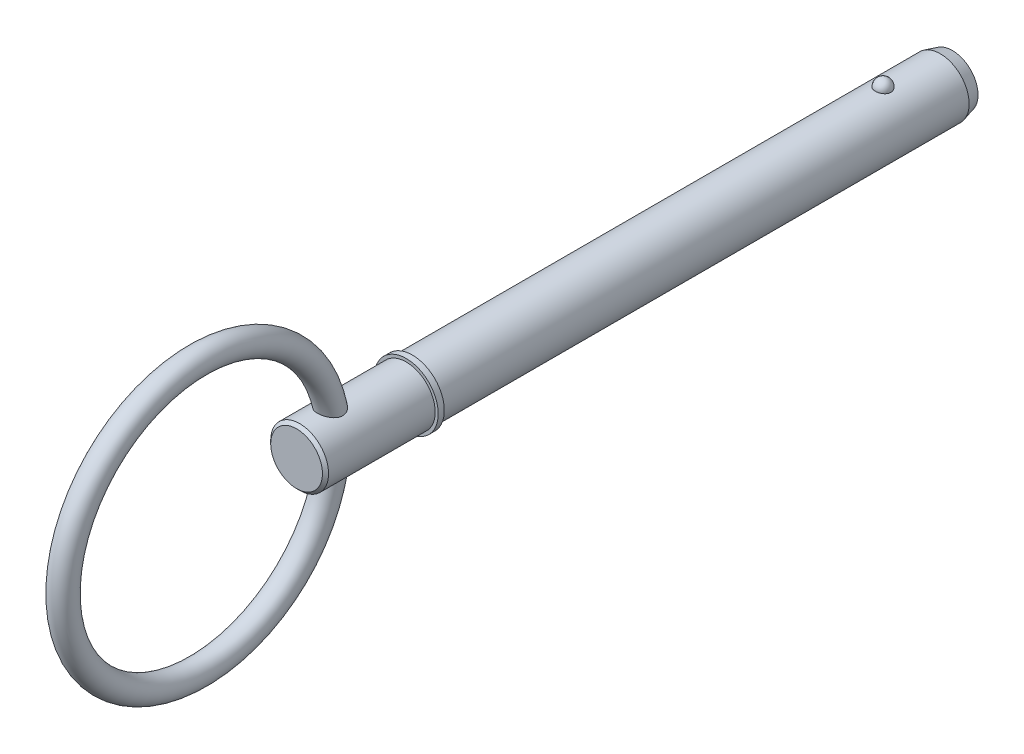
from build123d import *

# Parameters (mm, degrees)
SKETCH2_R           = 4.765
BOSS_EXTRUDE1_DEPTH = 76.2
BOSS_EXTRUDE2_START = 12.7
SKETCH3_R           = 4.765
BOSS_EXTRUDE2_DEPTH = 12.7
CHAMFER1_SIZE       = 2
CHAMFER1_SIZE2      = 0.535898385
SKETCH20_W          = 1
SKETCH20_H          = 5.265
SKETCH21_R          = 4.765
BOSS_EXTRUDE3_DEPTH = 19.05
CHAMFER2_SIZE       = 0.5
SKETCH24_R          = 2


with BuildPart() as part:
    # Sketch2 → Boss-Extrude1 (new body)
    with BuildSketch(Plane.XY):
        with Locations(Location((0, 0, 0), (0, 0, 180))):
            Circle(SKETCH2_R)
    extrude(amount=BOSS_EXTRUDE1_DEPTH)

    # Sketch3 → Boss-Extrude2 (add)
    with BuildSketch(Plane(origin=(0, 0, 0), x_dir=(-1, 0, 0), z_dir=(0, 0, -1)).offset(BOSS_EXTRUDE2_START)):
        Circle(SKETCH3_R)
    extrude(amount=-BOSS_EXTRUDE2_DEPTH)

    # Chamfer1
    chamfer1_edges = [part.edges().sort_by_distance(p)[0] for p in [
        (4.765, 0, -12.7),
    ]]
    chamfer1_side = [part.faces().sort_by_distance(p)[0] for p in [
        (4.765, 0, 31.75),
    ]]
    chamfer(chamfer1_edges, length=CHAMFER1_SIZE, length2=CHAMFER1_SIZE2, reference=chamfer1_side[0])

    # Sketch18 → Revolve1 (revolve)
    with BuildSketch(Plane(origin=(0, 0, 0), x_dir=(0, 0, -1), z_dir=(1, 0, 0))):
        with BuildLine():
            Line((1.29, 6.055), (1.29, 3.475))
            ThreePointArc((1.29, 3.475), (0, 4.765), (1.29, 6.055))
        make_face()
    revolve(axis=Axis((0, 6.055, -1.29), (0, -1, 0)))

    # Sketch20 → Revolve2 (revolve)
    with BuildSketch(Plane(origin=(0, 0, 0), x_dir=(0, 0, -1), z_dir=(1, 0, 0)), mode=Mode.PRIVATE) as revolve2_sk:
        with Locations((-76.7, 2.6325)):
            Rectangle(SKETCH20_W, SKETCH20_H)
    revolve(revolve2_sk.sketch.rotate(Axis((0, 0, 33.728787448), (0, 0, 1)), 90), axis=Axis((0, 0, 33.728787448), (0, 0, 1)))

    # Sketch21 → Boss-Extrude3 (add)
    with BuildSketch(Plane(origin=(0, 0, 76.2), x_dir=(-1, 0, 0), z_dir=(0, 0, -1))):
        Circle(SKETCH21_R)
    extrude(amount=-BOSS_EXTRUDE3_DEPTH)

    # Chamfer2
    chamfer2_edges = [part.edges().sort_by_distance(p)[0] for p in [
        (4.765, 0, 95.25),
    ]]
    chamfer(chamfer2_edges, length=CHAMFER2_SIZE)

    # Sweep1: sweep along a path in Sketch23
    with BuildLine(Plane(origin=(0, 0, 0), x_dir=(0, 0, -1), z_dir=(1, 0, 0))) as sweep1_path:
        CenterArc((-111.475, 0), 22.225, 0, 360)
    # Sketch24 → Sweep1 (sweep)
    with BuildSketch(Plane(origin=(0, 0, 0), x_dir=(1, 0, 0), z_dir=(0, 1, 0))):
        with Locations((0, -89.25)):
            Circle(SKETCH24_R)
    sweep(path=sweep1_path.line)


solid = part.part
